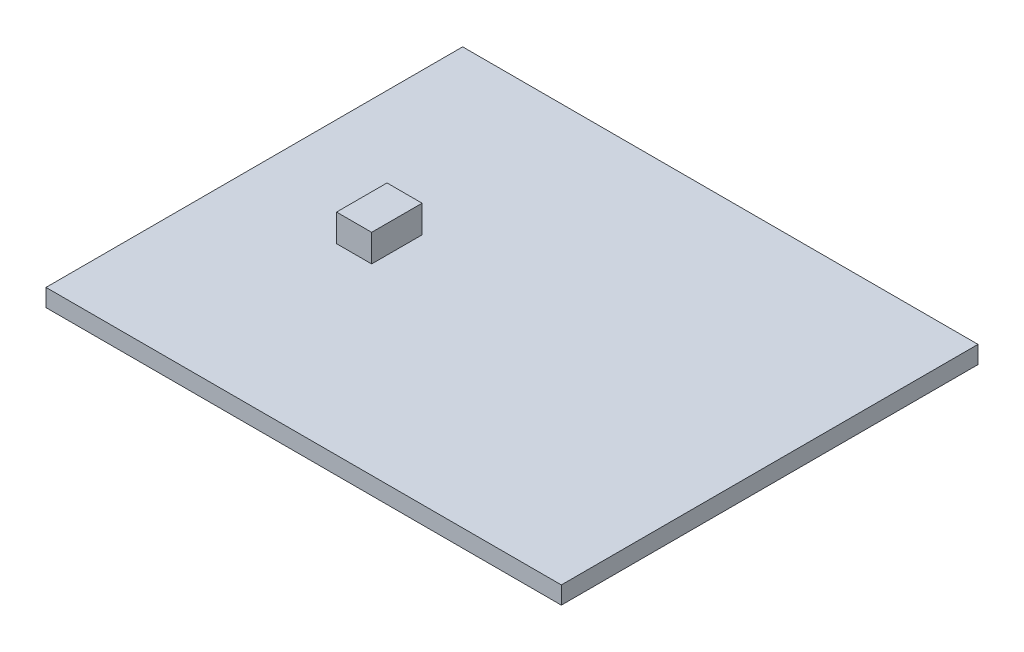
from build123d import *

# Parameters (mm, degrees)
SKETCH1_W           = 47
SKETCH1_H           = 38
BOSS_EXTRUDE1_DEPTH = 1.6
SKETCH2_W           = 3.2
SKETCH2_H           = 4.6
BOSS_EXTRUDE2_DEPTH = 2.5
SKETCH3_W           = 3.2
SKETCH3_H           = 4.6
BOSS_EXTRUDE3_DEPTH = 2.5


with BuildPart() as part:
    # Sketch1 → Boss-Extrude1 (new body)
    with BuildSketch(Plane(origin=(0, 0, 0), x_dir=(1, 0, 0), z_dir=(0, 1, 0))):
        with Locations((23.5, 19)):
            Rectangle(SKETCH1_W, SKETCH1_H)
    extrude(amount=BOSS_EXTRUDE1_DEPTH)

    # Sketch2 → Boss-Extrude2 (add)
    with BuildSketch(Plane(origin=(0, 1.6, 0), x_dir=(1, 0, 0), z_dir=(0, 1, 0))):
        with Locations((11.4, 19)):
            Rectangle(SKETCH2_W, SKETCH2_H)
    extrude(amount=BOSS_EXTRUDE2_DEPTH)

    # Sketch3 → Boss-Extrude3 (add)
    with BuildSketch(Plane.XZ):
        with Locations((11.4, -19)):
            Rectangle(SKETCH3_W, SKETCH3_H)
    extrude(amount=BOSS_EXTRUDE3_DEPTH)


solid = part.part
